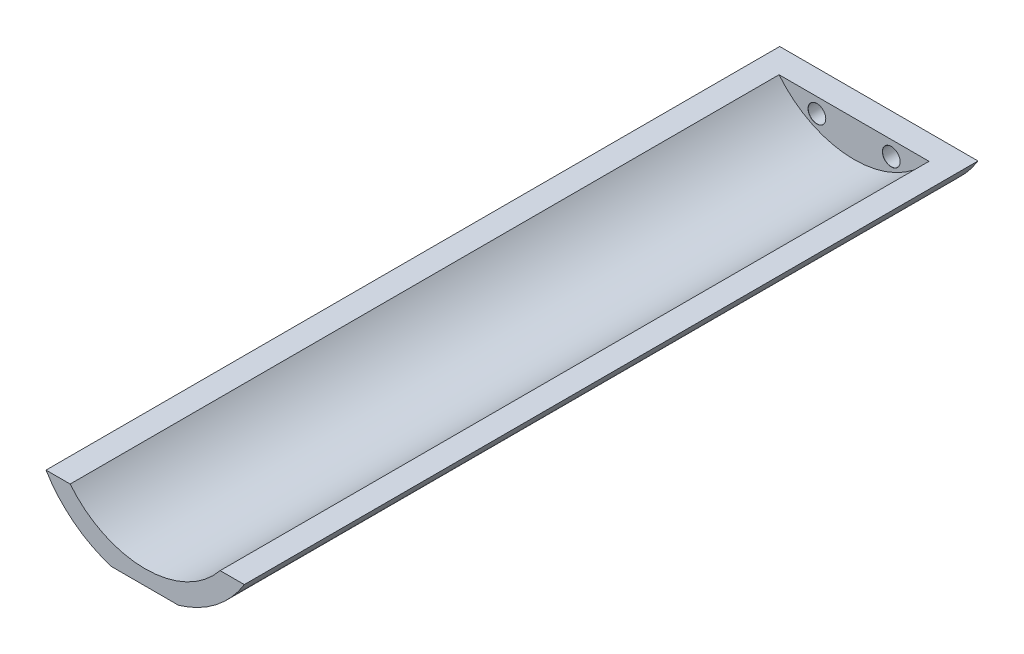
ISO-10303-21;
HEADER;
FILE_DESCRIPTION(('STEP AP214'),'2;1');
FILE_NAME('part.step','',(''),(''),'','','');
FILE_SCHEMA(('AUTOMOTIVE_DESIGN { 1 0 10303 214 1 1 1 1 }'));
ENDSEC;
DATA;
#1=APPLICATION_CONTEXT('core data for automotive mechanical design processes');
#2=APPLICATION_PROTOCOL_DEFINITION('international standard','automotive_design',2000,#1);
#3=PRODUCT_CONTEXT('',#1,'mechanical');
#4=PRODUCT('Part','Part','',(#3));
#5=PRODUCT_RELATED_PRODUCT_CATEGORY('part','',(#4));
#6=PRODUCT_DEFINITION_FORMATION('','',#4);
#7=PRODUCT_DEFINITION_CONTEXT('part definition',#1,'design');
#8=PRODUCT_DEFINITION('design','',#6,#7);
#9=PRODUCT_DEFINITION_SHAPE('','',#8);
#10=(LENGTH_UNIT() NAMED_UNIT(*) SI_UNIT(.MILLI.,.METRE.));
#11=(NAMED_UNIT(*) PLANE_ANGLE_UNIT() SI_UNIT($,.RADIAN.));
#12=(NAMED_UNIT(*) SI_UNIT($,.STERADIAN.) SOLID_ANGLE_UNIT());
#13=UNCERTAINTY_MEASURE_WITH_UNIT(LENGTH_MEASURE(1.E-05),#10,'distance_accuracy_value','');
#14=(GEOMETRIC_REPRESENTATION_CONTEXT(3) GLOBAL_UNCERTAINTY_ASSIGNED_CONTEXT((#13)) GLOBAL_UNIT_ASSIGNED_CONTEXT((#10,
#11,#12)) REPRESENTATION_CONTEXT('',''));
#15=CARTESIAN_POINT('',(0.,0.,0.));
#16=DIRECTION('',(0.,0.,1.));
#17=DIRECTION('',(1.,0.,0.));
#18=AXIS2_PLACEMENT_3D('',#15,#16,#17);
#19=CARTESIAN_POINT('',(0.,0.,-457.2));
#20=DIRECTION('',(0.,0.,1.));
#21=DIRECTION('',(1.,0.,0.));
#22=AXIS2_PLACEMENT_3D('',#19,#20,#21);
#23=CYLINDRICAL_SURFACE('',#22,29.718);
#24=CARTESIAN_POINT('',(0.,0.,-187.96));
#25=DIRECTION('',(0.,0.,1.));
#26=DIRECTION('',(1.,0.,0.));
#27=AXIS2_PLACEMENT_3D('',#24,#25,#26);
#28=CIRCLE('',#27,29.718);
#29=CARTESIAN_POINT('',(-25.4,-15.4272331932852,-187.96));
#30=VERTEX_POINT('',#29);
#31=CARTESIAN_POINT('',(-8.59481355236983,-28.448,-187.96));
#32=VERTEX_POINT('',#31);
#33=EDGE_CURVE('E135',#30,#32,#28,.T.);
#34=ORIENTED_EDGE('',*,*,#33,.T.);
#35=DIRECTION('',(0.,0.,1.));
#36=VECTOR('',#35,1.);
#37=CARTESIAN_POINT('',(-8.59481355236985,-28.448,-457.2));
#38=LINE('',#37,#36);
#39=CARTESIAN_POINT('',(-8.59481355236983,-28.448,0.));
#40=VERTEX_POINT('',#39);
#41=EDGE_CURVE('E100',#32,#40,#38,.T.);
#42=ORIENTED_EDGE('',*,*,#41,.T.);
#43=CARTESIAN_POINT('',(0.,0.,0.));
#44=DIRECTION('',(0.,0.,1.));
#45=DIRECTION('',(1.,0.,0.));
#46=AXIS2_PLACEMENT_3D('',#43,#44,#45);
#47=CIRCLE('',#46,29.718);
#48=CARTESIAN_POINT('',(-25.4,-15.4272331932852,0.));
#49=VERTEX_POINT('',#48);
#50=EDGE_CURVE('E107',#40,#49,#47,.F.);
#51=ORIENTED_EDGE('',*,*,#50,.T.);
#52=DIRECTION('',(0.,0.,1.));
#53=VECTOR('',#52,1.);
#54=CARTESIAN_POINT('',(-25.4,-15.4272331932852,-457.2));
#55=LINE('',#54,#53);
#56=EDGE_CURVE('E119',#30,#49,#55,.T.);
#57=ORIENTED_EDGE('',*,*,#56,.F.);
#58=EDGE_LOOP('',(#34,#42,#51,#57));
#59=FACE_BOUND('',#58,.T.);
#60=ADVANCED_FACE('F41',(#59),#23,.T.);
#61=CARTESIAN_POINT('',(25.4,-15.4272331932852,0.));
#62=VERTEX_POINT('',#61);
#63=CARTESIAN_POINT('',(8.59481355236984,-28.448,0.));
#64=VERTEX_POINT('',#63);
#65=EDGE_CURVE('E106',#62,#64,#47,.F.);
#66=ORIENTED_EDGE('',*,*,#65,.T.);
#67=DIRECTION('',(0.,0.,1.));
#68=VECTOR('',#67,1.);
#69=CARTESIAN_POINT('',(8.59481355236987,-28.448,-457.2));
#70=LINE('',#69,#68);
#71=CARTESIAN_POINT('',(8.59481355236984,-28.448,-187.96));
#72=VERTEX_POINT('',#71);
#73=EDGE_CURVE('E92',#64,#72,#70,.F.);
#74=ORIENTED_EDGE('',*,*,#73,.T.);
#75=CARTESIAN_POINT('',(25.4,-15.4272331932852,-187.96));
#76=VERTEX_POINT('',#75);
#77=EDGE_CURVE('E138',#72,#76,#28,.T.);
#78=ORIENTED_EDGE('',*,*,#77,.T.);
#79=DIRECTION('',(0.,0.,1.));
#80=VECTOR('',#79,1.);
#81=CARTESIAN_POINT('',(25.4,-15.4272331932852,-457.2));
#82=LINE('',#81,#80);
#83=EDGE_CURVE('E49',#76,#62,#82,.T.);
#84=ORIENTED_EDGE('',*,*,#83,.T.);
#85=EDGE_LOOP('',(#66,#74,#78,#84));
#86=FACE_BOUND('',#85,.T.);
#87=ADVANCED_FACE('F111',(#86),#23,.T.);
#88=CARTESIAN_POINT('',(0.,-15.4272331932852,-457.2));
#89=DIRECTION('',(0.,1.,0.));
#90=DIRECTION('',(-1.,0.,0.));
#91=AXIS2_PLACEMENT_3D('',#88,#89,#90);
#92=PLANE('',#91);
#93=ORIENTED_EDGE('',*,*,#83,.F.);
#94=DIRECTION('',(1.,0.,0.));
#95=VECTOR('',#94,1.);
#96=CARTESIAN_POINT('',(0.,-15.4272331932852,-187.96));
#97=LINE('',#96,#95);
#98=EDGE_CURVE('E139',#30,#76,#97,.T.);
#99=ORIENTED_EDGE('',*,*,#98,.F.);
#100=ORIENTED_EDGE('',*,*,#56,.T.);
#101=DIRECTION('',(-1.,0.,0.));
#102=VECTOR('',#101,1.);
#103=CARTESIAN_POINT('',(0.,-15.4272331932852,0.));
#104=LINE('',#103,#102);
#105=CARTESIAN_POINT('',(-19.2101931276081,-15.4272331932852,0.));
#106=VERTEX_POINT('',#105);
#107=EDGE_CURVE('E114',#106,#49,#104,.T.);
#108=ORIENTED_EDGE('',*,*,#107,.F.);
#109=DIRECTION('',(0.,0.,1.));
#110=VECTOR('',#109,1.);
#111=CARTESIAN_POINT('',(-19.2101931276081,-15.4272331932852,-457.2));
#112=LINE('',#111,#110);
#113=CARTESIAN_POINT('',(-19.2101931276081,-15.4272331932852,-181.61));
#114=VERTEX_POINT('',#113);
#115=EDGE_CURVE('E112',#114,#106,#112,.T.);
#116=ORIENTED_EDGE('',*,*,#115,.F.);
#117=DIRECTION('',(-1.,0.,0.));
#118=VECTOR('',#117,1.);
#119=CARTESIAN_POINT('',(0.,-15.4272331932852,-181.61));
#120=LINE('',#119,#118);
#121=CARTESIAN_POINT('',(19.2101931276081,-15.4272331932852,-181.61));
#122=VERTEX_POINT('',#121);
#123=EDGE_CURVE('E141',#122,#114,#120,.T.);
#124=ORIENTED_EDGE('',*,*,#123,.F.);
#125=DIRECTION('',(0.,0.,1.));
#126=VECTOR('',#125,1.);
#127=CARTESIAN_POINT('',(19.2101931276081,-15.4272331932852,-457.2));
#128=LINE('',#127,#126);
#129=CARTESIAN_POINT('',(19.2101931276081,-15.4272331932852,0.));
#130=VERTEX_POINT('',#129);
#131=EDGE_CURVE('E44',#122,#130,#128,.T.);
#132=ORIENTED_EDGE('',*,*,#131,.T.);
#133=DIRECTION('',(1.,0.,0.));
#134=VECTOR('',#133,1.);
#135=CARTESIAN_POINT('',(0.,-15.4272331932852,0.));
#136=LINE('',#135,#134);
#137=EDGE_CURVE('E134',#130,#62,#136,.T.);
#138=ORIENTED_EDGE('',*,*,#137,.T.);
#139=EDGE_LOOP('',(#93,#99,#100,#108,#116,#124,#132,#138));
#140=FACE_BOUND('',#139,.T.);
#141=ADVANCED_FACE('F126',(#140),#92,.T.);
#142=CARTESIAN_POINT('',(0.,0.,-457.2));
#143=DIRECTION('',(0.,0.,1.));
#144=DIRECTION('',(1.,0.,0.));
#145=AXIS2_PLACEMENT_3D('',#142,#143,#144);
#146=CYLINDRICAL_SURFACE('',#145,24.638);
#147=CARTESIAN_POINT('',(0.,0.,-181.61));
#148=DIRECTION('',(0.,0.,-1.));
#149=DIRECTION('',(-1.,0.,0.));
#150=AXIS2_PLACEMENT_3D('',#147,#148,#149);
#151=CIRCLE('',#150,24.638);
#152=EDGE_CURVE('E61',#114,#122,#151,.F.);
#153=ORIENTED_EDGE('',*,*,#152,.F.);
#154=ORIENTED_EDGE('',*,*,#115,.T.);
#155=CARTESIAN_POINT('',(0.,0.,0.));
#156=DIRECTION('',(0.,0.,1.));
#157=DIRECTION('',(1.,0.,0.));
#158=AXIS2_PLACEMENT_3D('',#155,#156,#157);
#159=CIRCLE('',#158,24.638);
#160=EDGE_CURVE('E123',#130,#106,#159,.F.);
#161=ORIENTED_EDGE('',*,*,#160,.F.);
#162=ORIENTED_EDGE('',*,*,#131,.F.);
#163=EDGE_LOOP('',(#153,#154,#161,#162));
#164=FACE_BOUND('',#163,.T.);
#165=ADVANCED_FACE('F43',(#164),#146,.F.);
#166=CARTESIAN_POINT('',(0.,0.,0.));
#167=DIRECTION('',(0.,0.,1.));
#168=DIRECTION('',(1.,0.,0.));
#169=AXIS2_PLACEMENT_3D('',#166,#167,#168);
#170=PLANE('',#169);
#171=DIRECTION('',(-1.,0.,0.));
#172=VECTOR('',#171,1.);
#173=CARTESIAN_POINT('',(22.8195116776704,-28.448,0.));
#174=LINE('',#173,#172);
#175=EDGE_CURVE('E94',#64,#40,#174,.T.);
#176=ORIENTED_EDGE('',*,*,#175,.F.);
#177=ORIENTED_EDGE('',*,*,#65,.F.);
#178=ORIENTED_EDGE('',*,*,#137,.F.);
#179=ORIENTED_EDGE('',*,*,#160,.T.);
#180=ORIENTED_EDGE('',*,*,#107,.T.);
#181=ORIENTED_EDGE('',*,*,#50,.F.);
#182=EDGE_LOOP('',(#176,#177,#178,#179,#180,#181));
#183=FACE_BOUND('',#182,.T.);
#184=ADVANCED_FACE('F104',(#183),#170,.T.);
#185=CARTESIAN_POINT('',(88.9,-29.718,-187.96));
#186=DIRECTION('',(0.,0.,1.));
#187=DIRECTION('',(1.,0.,0.));
#188=AXIS2_PLACEMENT_3D('',#185,#186,#187);
#189=PLANE('',#188);
#190=CARTESIAN_POINT('',(-9.52500000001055,-19.2372331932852,-187.96));
#191=DIRECTION('',(0.,0.,1.));
#192=DIRECTION('',(1.,0.,0.));
#193=AXIS2_PLACEMENT_3D('',#190,#191,#192);
#194=CIRCLE('',#193,2.24999999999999);
#195=CARTESIAN_POINT('',(-7.27500000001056,-19.2372331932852,-187.96));
#196=VERTEX_POINT('',#195);
#197=EDGE_CURVE('E151',#196,#196,#194,.T.);
#198=ORIENTED_EDGE('',*,*,#197,.T.);
#199=EDGE_LOOP('',(#198));
#200=FACE_BOUND('',#199,.T.);
#201=CARTESIAN_POINT('',(9.52499999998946,-19.2372331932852,-187.96));
#202=DIRECTION('',(0.,0.,1.));
#203=DIRECTION('',(1.,0.,0.));
#204=AXIS2_PLACEMENT_3D('',#201,#202,#203);
#205=CIRCLE('',#204,2.24999999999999);
#206=CARTESIAN_POINT('',(11.7749999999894,-19.2372331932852,-187.96));
#207=VERTEX_POINT('',#206);
#208=EDGE_CURVE('E143',#207,#207,#205,.T.);
#209=ORIENTED_EDGE('',*,*,#208,.T.);
#210=EDGE_LOOP('',(#209));
#211=FACE_BOUND('',#210,.T.);
#212=ORIENTED_EDGE('',*,*,#77,.F.);
#213=DIRECTION('',(-1.,0.,0.));
#214=VECTOR('',#213,1.);
#215=CARTESIAN_POINT('',(22.8195116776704,-28.448,-187.96));
#216=LINE('',#215,#214);
#217=EDGE_CURVE('E11',#72,#32,#216,.T.);
#218=ORIENTED_EDGE('',*,*,#217,.T.);
#219=ORIENTED_EDGE('',*,*,#33,.F.);
#220=ORIENTED_EDGE('',*,*,#98,.T.);
#221=EDGE_LOOP('',(#212,#218,#219,#220));
#222=FACE_BOUND('',#221,.T.);
#223=ADVANCED_FACE('F164',(#200,#211,#222),#189,.F.);
#224=CARTESIAN_POINT('',(0.,0.,-181.61));
#225=DIRECTION('',(0.,0.,-1.));
#226=DIRECTION('',(-1.,0.,0.));
#227=AXIS2_PLACEMENT_3D('',#224,#225,#226);
#228=PLANE('',#227);
#229=CARTESIAN_POINT('',(-9.52500000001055,-19.2372331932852,-181.61));
#230=DIRECTION('',(0.,0.,1.));
#231=DIRECTION('',(1.,0.,0.));
#232=AXIS2_PLACEMENT_3D('',#229,#230,#231);
#233=CIRCLE('',#232,2.275);
#234=CARTESIAN_POINT('',(-7.25000000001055,-19.2372331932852,-181.61));
#235=VERTEX_POINT('',#234);
#236=EDGE_CURVE('E156',#235,#235,#233,.T.);
#237=ORIENTED_EDGE('',*,*,#236,.F.);
#238=EDGE_LOOP('',(#237));
#239=FACE_BOUND('',#238,.T.);
#240=CARTESIAN_POINT('',(9.52499999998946,-19.2372331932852,-181.61));
#241=DIRECTION('',(0.,0.,1.));
#242=DIRECTION('',(1.,0.,0.));
#243=AXIS2_PLACEMENT_3D('',#240,#241,#242);
#244=CIRCLE('',#243,2.275);
#245=CARTESIAN_POINT('',(11.7999999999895,-19.2372331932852,-181.61));
#246=VERTEX_POINT('',#245);
#247=EDGE_CURVE('E152',#246,#246,#244,.T.);
#248=ORIENTED_EDGE('',*,*,#247,.F.);
#249=EDGE_LOOP('',(#248));
#250=FACE_BOUND('',#249,.T.);
#251=ORIENTED_EDGE('',*,*,#123,.T.);
#252=ORIENTED_EDGE('',*,*,#152,.T.);
#253=EDGE_LOOP('',(#251,#252));
#254=FACE_BOUND('',#253,.T.);
#255=ADVANCED_FACE('F170',(#239,#250,#254),#228,.F.);
#256=CARTESIAN_POINT('',(9.52499999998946,-19.2372331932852,-181.61));
#257=DIRECTION('',(0.,0.,1.));
#258=DIRECTION('',(1.,0.,0.));
#259=AXIS2_PLACEMENT_3D('',#256,#257,#258);
#260=CYLINDRICAL_SURFACE('',#259,2.24999999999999);
#261=ORIENTED_EDGE('',*,*,#208,.F.);
#262=EDGE_LOOP('',(#261));
#263=FACE_BOUND('',#262,.T.);
#264=CARTESIAN_POINT('',(9.52499999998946,-19.2372331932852,-181.635));
#265=DIRECTION('',(0.,0.,1.));
#266=DIRECTION('',(1.,0.,0.));
#267=AXIS2_PLACEMENT_3D('',#264,#265,#266);
#268=CIRCLE('',#267,2.25);
#269=CARTESIAN_POINT('',(11.7749999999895,-19.2372331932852,-181.635));
#270=VERTEX_POINT('',#269);
#271=EDGE_CURVE('E149',#270,#270,#268,.T.);
#272=ORIENTED_EDGE('',*,*,#271,.T.);
#273=EDGE_LOOP('',(#272));
#274=FACE_BOUND('',#273,.T.);
#275=ADVANCED_FACE('F169',(#263,#274),#260,.F.);
#276=CARTESIAN_POINT('',(9.52499999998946,-19.2372331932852,-181.61));
#277=DIRECTION('',(0.,0.,1.));
#278=DIRECTION('',(1.,0.,0.));
#279=AXIS2_PLACEMENT_3D('',#276,#277,#278);
#280=CONICAL_SURFACE('',#279,2.275,0.785398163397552);
#281=ORIENTED_EDGE('',*,*,#271,.F.);
#282=EDGE_LOOP('',(#281));
#283=FACE_BOUND('',#282,.T.);
#284=ORIENTED_EDGE('',*,*,#247,.T.);
#285=EDGE_LOOP('',(#284));
#286=FACE_BOUND('',#285,.T.);
#287=ADVANCED_FACE('F176',(#283,#286),#280,.F.);
#288=CARTESIAN_POINT('',(-9.52500000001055,-19.2372331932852,-181.61));
#289=DIRECTION('',(0.,0.,1.));
#290=DIRECTION('',(1.,0.,0.));
#291=AXIS2_PLACEMENT_3D('',#288,#289,#290);
#292=CYLINDRICAL_SURFACE('',#291,2.24999999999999);
#293=ORIENTED_EDGE('',*,*,#197,.F.);
#294=EDGE_LOOP('',(#293));
#295=FACE_BOUND('',#294,.T.);
#296=CARTESIAN_POINT('',(-9.52500000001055,-19.2372331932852,-181.635));
#297=DIRECTION('',(0.,0.,1.));
#298=DIRECTION('',(1.,0.,0.));
#299=AXIS2_PLACEMENT_3D('',#296,#297,#298);
#300=CIRCLE('',#299,2.25);
#301=CARTESIAN_POINT('',(-7.27500000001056,-19.2372331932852,-181.635));
#302=VERTEX_POINT('',#301);
#303=EDGE_CURVE('E160',#302,#302,#300,.T.);
#304=ORIENTED_EDGE('',*,*,#303,.T.);
#305=EDGE_LOOP('',(#304));
#306=FACE_BOUND('',#305,.T.);
#307=ADVANCED_FACE('F226',(#295,#306),#292,.F.);
#308=CARTESIAN_POINT('',(-9.52500000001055,-19.2372331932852,-181.61));
#309=DIRECTION('',(0.,0.,1.));
#310=DIRECTION('',(1.,0.,0.));
#311=AXIS2_PLACEMENT_3D('',#308,#309,#310);
#312=CONICAL_SURFACE('',#311,2.275,0.785398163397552);
#313=ORIENTED_EDGE('',*,*,#303,.F.);
#314=EDGE_LOOP('',(#313));
#315=FACE_BOUND('',#314,.T.);
#316=ORIENTED_EDGE('',*,*,#236,.T.);
#317=EDGE_LOOP('',(#316));
#318=FACE_BOUND('',#317,.T.);
#319=ADVANCED_FACE('F214',(#315,#318),#312,.F.);
#320=CARTESIAN_POINT('',(22.8195116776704,-28.448,-187.96));
#321=DIRECTION('',(0.,1.,0.));
#322=DIRECTION('',(-1.,0.,0.));
#323=AXIS2_PLACEMENT_3D('',#320,#321,#322);
#324=PLANE('',#323);
#325=ORIENTED_EDGE('',*,*,#217,.F.);
#326=ORIENTED_EDGE('',*,*,#73,.F.);
#327=ORIENTED_EDGE('',*,*,#175,.T.);
#328=ORIENTED_EDGE('',*,*,#41,.F.);
#329=EDGE_LOOP('',(#325,#326,#327,#328));
#330=FACE_BOUND('',#329,.T.);
#331=ADVANCED_FACE('F93',(#330),#324,.F.);
#332=CLOSED_SHELL('',(#60,#87,#141,#165,#184,#223,#255,#275,#287,#307,#319,#331));
#333=MANIFOLD_SOLID_BREP('B2',#332);
#334=ADVANCED_BREP_SHAPE_REPRESENTATION('',(#18,#333),#14);
#335=SHAPE_DEFINITION_REPRESENTATION(#9,#334);
ENDSEC;
END-ISO-10303-21;
